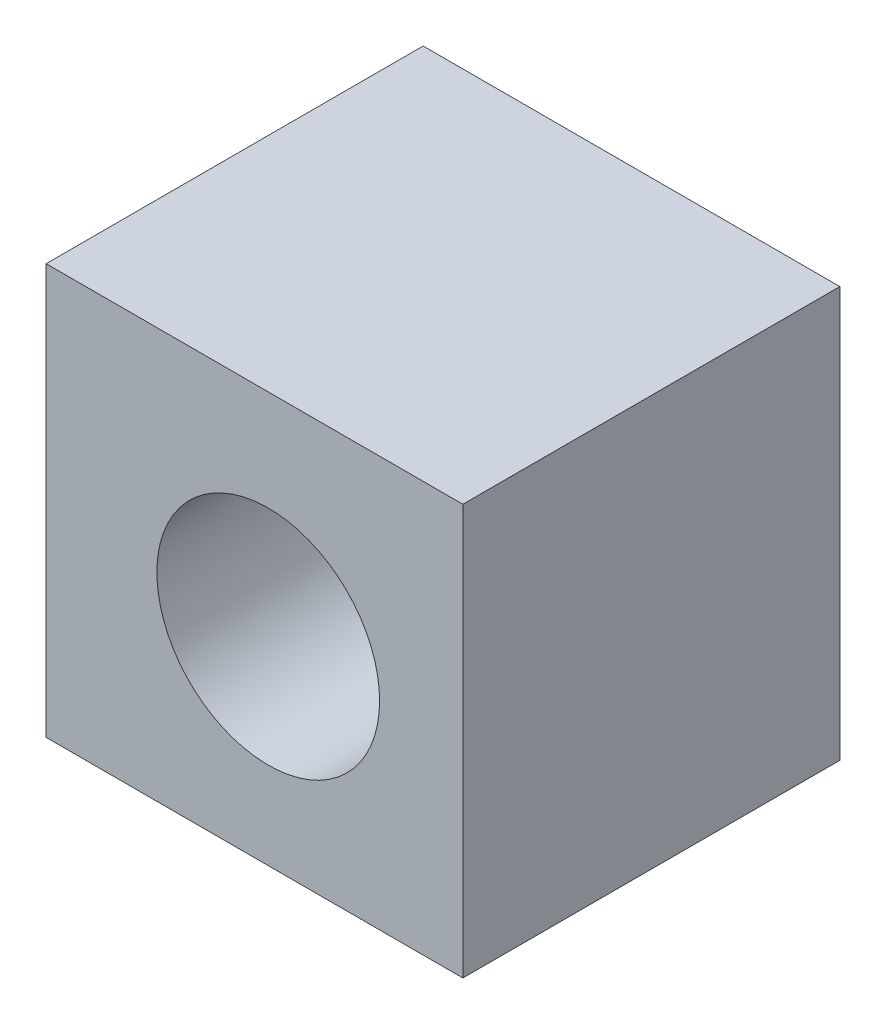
ISO-10303-21;
HEADER;
FILE_DESCRIPTION(('STEP AP214'),'2;1');
FILE_NAME('part.step','',(''),(''),'','','');
FILE_SCHEMA(('AUTOMOTIVE_DESIGN { 1 0 10303 214 1 1 1 1 }'));
ENDSEC;
DATA;
#1=APPLICATION_CONTEXT('core data for automotive mechanical design processes');
#2=APPLICATION_PROTOCOL_DEFINITION('international standard','automotive_design',2000,#1);
#3=PRODUCT_CONTEXT('',#1,'mechanical');
#4=PRODUCT('Part','Part','',(#3));
#5=PRODUCT_RELATED_PRODUCT_CATEGORY('part','',(#4));
#6=PRODUCT_DEFINITION_FORMATION('','',#4);
#7=PRODUCT_DEFINITION_CONTEXT('part definition',#1,'design');
#8=PRODUCT_DEFINITION('design','',#6,#7);
#9=PRODUCT_DEFINITION_SHAPE('','',#8);
#10=(LENGTH_UNIT() NAMED_UNIT(*) SI_UNIT(.MILLI.,.METRE.));
#11=(NAMED_UNIT(*) PLANE_ANGLE_UNIT() SI_UNIT($,.RADIAN.));
#12=(NAMED_UNIT(*) SI_UNIT($,.STERADIAN.) SOLID_ANGLE_UNIT());
#13=UNCERTAINTY_MEASURE_WITH_UNIT(LENGTH_MEASURE(1.E-05),#10,'distance_accuracy_value','');
#14=(GEOMETRIC_REPRESENTATION_CONTEXT(3) GLOBAL_UNCERTAINTY_ASSIGNED_CONTEXT((#13)) GLOBAL_UNIT_ASSIGNED_CONTEXT((#10,
#11,#12)) REPRESENTATION_CONTEXT('',''));
#15=CARTESIAN_POINT('',(0.,0.,0.));
#16=DIRECTION('',(0.,0.,1.));
#17=DIRECTION('',(1.,0.,0.));
#18=AXIS2_PLACEMENT_3D('',#15,#16,#17);
#19=CARTESIAN_POINT('',(38.3061852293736,34.2169341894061,-0.00999999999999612));
#20=DIRECTION('',(0.,0.,1.));
#21=DIRECTION('',(1.,0.,0.));
#22=AXIS2_PLACEMENT_3D('',#19,#20,#21);
#23=CYLINDRICAL_SURFACE('',#22,19.2044359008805);
#24=CARTESIAN_POINT('',(38.3061852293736,34.2169341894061,65.024));
#25=DIRECTION('',(0.,0.,1.));
#26=DIRECTION('',(1.,0.,0.));
#27=AXIS2_PLACEMENT_3D('',#24,#25,#26);
#28=CIRCLE('',#27,19.2044359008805);
#29=CARTESIAN_POINT('',(57.5106211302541,34.2169341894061,65.024));
#30=VERTEX_POINT('',#29);
#31=EDGE_CURVE('E11',#30,#30,#28,.T.);
#32=ORIENTED_EDGE('',*,*,#31,.T.);
#33=EDGE_LOOP('',(#32));
#34=FACE_BOUND('',#33,.T.);
#35=CARTESIAN_POINT('',(38.3061852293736,34.2169341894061,0.));
#36=DIRECTION('',(0.,0.,1.));
#37=DIRECTION('',(1.,0.,0.));
#38=AXIS2_PLACEMENT_3D('',#35,#36,#37);
#39=CIRCLE('',#38,19.2044359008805);
#40=CARTESIAN_POINT('',(57.5106211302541,34.2169341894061,0.));
#41=VERTEX_POINT('',#40);
#42=EDGE_CURVE('E34',#41,#41,#39,.T.);
#43=ORIENTED_EDGE('',*,*,#42,.F.);
#44=EDGE_LOOP('',(#43));
#45=FACE_BOUND('',#44,.T.);
#46=ADVANCED_FACE('F26',(#34,#45),#23,.F.);
#47=CARTESIAN_POINT('',(0.,0.,65.024));
#48=DIRECTION('',(0.,1.,0.));
#49=DIRECTION('',(0.,0.,1.));
#50=AXIS2_PLACEMENT_3D('',#47,#48,#49);
#51=PLANE('',#50);
#52=DIRECTION('',(1.,0.,0.));
#53=VECTOR('',#52,1.);
#54=CARTESIAN_POINT('',(0.,0.,0.));
#55=LINE('',#54,#53);
#56=CARTESIAN_POINT('',(0.,0.,0.));
#57=VERTEX_POINT('',#56);
#58=CARTESIAN_POINT('',(71.8678259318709,0.,0.));
#59=VERTEX_POINT('',#58);
#60=EDGE_CURVE('E79',#57,#59,#55,.T.);
#61=ORIENTED_EDGE('',*,*,#60,.T.);
#62=DIRECTION('',(0.,0.,-1.));
#63=VECTOR('',#62,1.);
#64=CARTESIAN_POINT('',(71.8678259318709,0.,65.024));
#65=LINE('',#64,#63);
#66=CARTESIAN_POINT('',(71.8678259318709,0.,65.024));
#67=VERTEX_POINT('',#66);
#68=EDGE_CURVE('E87',#67,#59,#65,.T.);
#69=ORIENTED_EDGE('',*,*,#68,.F.);
#70=DIRECTION('',(1.,0.,0.));
#71=VECTOR('',#70,1.);
#72=CARTESIAN_POINT('',(0.,0.,65.024));
#73=LINE('',#72,#71);
#74=CARTESIAN_POINT('',(0.,0.,65.024));
#75=VERTEX_POINT('',#74);
#76=EDGE_CURVE('E86',#75,#67,#73,.T.);
#77=ORIENTED_EDGE('',*,*,#76,.F.);
#78=DIRECTION('',(0.,0.,-1.));
#79=VECTOR('',#78,1.);
#80=CARTESIAN_POINT('',(0.,0.,65.024));
#81=LINE('',#80,#79);
#82=EDGE_CURVE('E71',#75,#57,#81,.T.);
#83=ORIENTED_EDGE('',*,*,#82,.T.);
#84=EDGE_LOOP('',(#61,#69,#77,#83));
#85=FACE_BOUND('',#84,.T.);
#86=ADVANCED_FACE('F28',(#85),#51,.F.);
#87=CARTESIAN_POINT('',(71.8678259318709,0.,65.024));
#88=DIRECTION('',(-1.,0.,0.));
#89=DIRECTION('',(0.,0.,1.));
#90=AXIS2_PLACEMENT_3D('',#87,#88,#89);
#91=PLANE('',#90);
#92=DIRECTION('',(0.,1.,0.));
#93=VECTOR('',#92,1.);
#94=CARTESIAN_POINT('',(71.8678259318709,0.,0.));
#95=LINE('',#94,#93);
#96=CARTESIAN_POINT('',(71.8678259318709,70.7640538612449,0.));
#97=VERTEX_POINT('',#96);
#98=EDGE_CURVE('E81',#59,#97,#95,.T.);
#99=ORIENTED_EDGE('',*,*,#98,.T.);
#100=DIRECTION('',(0.,0.,-1.));
#101=VECTOR('',#100,1.);
#102=CARTESIAN_POINT('',(71.8678259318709,70.7640538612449,65.024));
#103=LINE('',#102,#101);
#104=CARTESIAN_POINT('',(71.8678259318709,70.7640538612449,65.024));
#105=VERTEX_POINT('',#104);
#106=EDGE_CURVE('E90',#105,#97,#103,.T.);
#107=ORIENTED_EDGE('',*,*,#106,.F.);
#108=DIRECTION('',(0.,1.,0.));
#109=VECTOR('',#108,1.);
#110=CARTESIAN_POINT('',(71.8678259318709,0.,65.024));
#111=LINE('',#110,#109);
#112=EDGE_CURVE('E48',#67,#105,#111,.T.);
#113=ORIENTED_EDGE('',*,*,#112,.F.);
#114=ORIENTED_EDGE('',*,*,#68,.T.);
#115=EDGE_LOOP('',(#99,#107,#113,#114));
#116=FACE_BOUND('',#115,.T.);
#117=ADVANCED_FACE('F103',(#116),#91,.F.);
#118=CARTESIAN_POINT('',(0.,70.7640538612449,65.024));
#119=DIRECTION('',(0.,-1.,0.));
#120=DIRECTION('',(0.,0.,-1.));
#121=AXIS2_PLACEMENT_3D('',#118,#119,#120);
#122=PLANE('',#121);
#123=DIRECTION('',(-1.,0.,0.));
#124=VECTOR('',#123,1.);
#125=CARTESIAN_POINT('',(0.,70.7640538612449,0.));
#126=LINE('',#125,#124);
#127=CARTESIAN_POINT('',(0.,70.7640538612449,0.));
#128=VERTEX_POINT('',#127);
#129=EDGE_CURVE('E76',#97,#128,#126,.T.);
#130=ORIENTED_EDGE('',*,*,#129,.T.);
#131=DIRECTION('',(0.,0.,-1.));
#132=VECTOR('',#131,1.);
#133=CARTESIAN_POINT('',(0.,70.7640538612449,65.024));
#134=LINE('',#133,#132);
#135=CARTESIAN_POINT('',(0.,70.7640538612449,65.024));
#136=VERTEX_POINT('',#135);
#137=EDGE_CURVE('E73',#136,#128,#134,.T.);
#138=ORIENTED_EDGE('',*,*,#137,.F.);
#139=DIRECTION('',(-1.,0.,0.));
#140=VECTOR('',#139,1.);
#141=CARTESIAN_POINT('',(0.,70.7640538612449,65.024));
#142=LINE('',#141,#140);
#143=EDGE_CURVE('E96',#105,#136,#142,.T.);
#144=ORIENTED_EDGE('',*,*,#143,.F.);
#145=ORIENTED_EDGE('',*,*,#106,.T.);
#146=EDGE_LOOP('',(#130,#138,#144,#145));
#147=FACE_BOUND('',#146,.T.);
#148=ADVANCED_FACE('F106',(#147),#122,.F.);
#149=CARTESIAN_POINT('',(-30.6603352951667,34.2169341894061,0.));
#150=DIRECTION('',(0.,0.,1.));
#151=DIRECTION('',(1.,0.,0.));
#152=AXIS2_PLACEMENT_3D('',#149,#150,#151);
#153=PLANE('',#152);
#154=ORIENTED_EDGE('',*,*,#42,.T.);
#155=EDGE_LOOP('',(#154));
#156=FACE_BOUND('',#155,.T.);
#157=ORIENTED_EDGE('',*,*,#60,.F.);
#158=DIRECTION('',(0.,-1.,0.));
#159=VECTOR('',#158,1.);
#160=CARTESIAN_POINT('',(0.,52.6131353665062,0.));
#161=LINE('',#160,#159);
#162=EDGE_CURVE('E67',#128,#57,#161,.T.);
#163=ORIENTED_EDGE('',*,*,#162,.F.);
#164=ORIENTED_EDGE('',*,*,#129,.F.);
#165=ORIENTED_EDGE('',*,*,#98,.F.);
#166=EDGE_LOOP('',(#157,#163,#164,#165));
#167=FACE_BOUND('',#166,.T.);
#168=ADVANCED_FACE('F80',(#156,#167),#153,.F.);
#169=CARTESIAN_POINT('',(-30.6603352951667,34.2169341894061,65.024));
#170=DIRECTION('',(0.,0.,1.));
#171=DIRECTION('',(1.,0.,0.));
#172=AXIS2_PLACEMENT_3D('',#169,#170,#171);
#173=PLANE('',#172);
#174=ORIENTED_EDGE('',*,*,#31,.F.);
#175=EDGE_LOOP('',(#174));
#176=FACE_BOUND('',#175,.T.);
#177=ORIENTED_EDGE('',*,*,#143,.T.);
#178=DIRECTION('',(0.,-1.,0.));
#179=VECTOR('',#178,1.);
#180=CARTESIAN_POINT('',(0.,0.,65.024));
#181=LINE('',#180,#179);
#182=EDGE_CURVE('E41',#136,#75,#181,.T.);
#183=ORIENTED_EDGE('',*,*,#182,.T.);
#184=ORIENTED_EDGE('',*,*,#76,.T.);
#185=ORIENTED_EDGE('',*,*,#112,.T.);
#186=EDGE_LOOP('',(#177,#183,#184,#185));
#187=FACE_BOUND('',#186,.T.);
#188=ADVANCED_FACE('F107',(#176,#187),#173,.T.);
#189=CARTESIAN_POINT('',(0.,52.6131353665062,65.024));
#190=DIRECTION('',(1.,0.,0.));
#191=DIRECTION('',(0.,0.,-1.));
#192=AXIS2_PLACEMENT_3D('',#189,#190,#191);
#193=PLANE('',#192);
#194=ORIENTED_EDGE('',*,*,#162,.T.);
#195=ORIENTED_EDGE('',*,*,#82,.F.);
#196=ORIENTED_EDGE('',*,*,#182,.F.);
#197=ORIENTED_EDGE('',*,*,#137,.T.);
#198=EDGE_LOOP('',(#194,#195,#196,#197));
#199=FACE_BOUND('',#198,.T.);
#200=ADVANCED_FACE('F69',(#199),#193,.F.);
#201=CLOSED_SHELL('',(#46,#86,#117,#148,#168,#188,#200));
#202=MANIFOLD_SOLID_BREP('B2',#201);
#203=ADVANCED_BREP_SHAPE_REPRESENTATION('',(#18,#202),#14);
#204=SHAPE_DEFINITION_REPRESENTATION(#9,#203);
ENDSEC;
END-ISO-10303-21;
